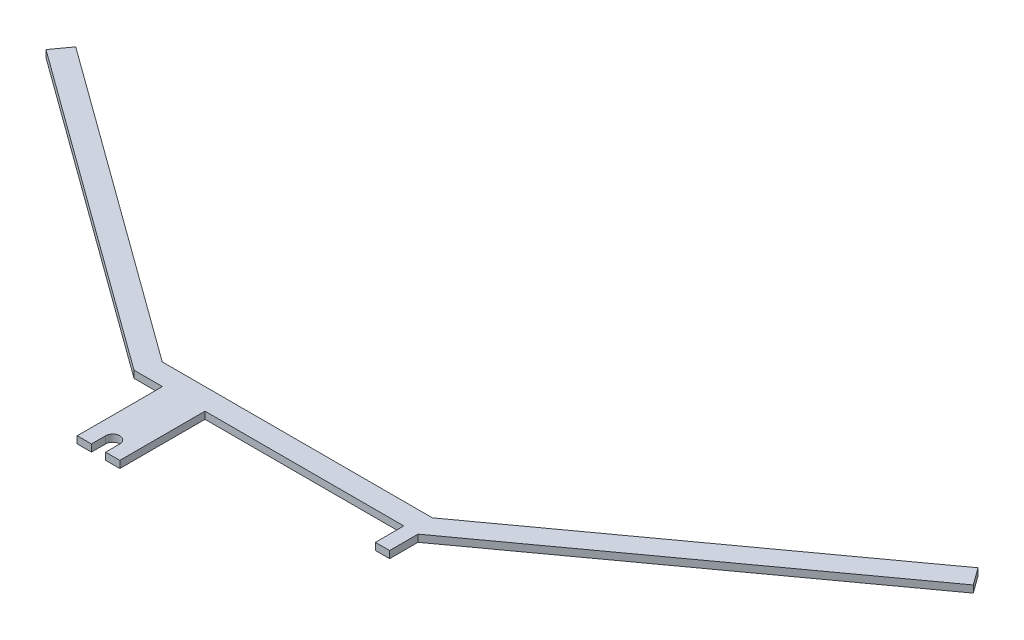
from build123d import *

# Parameters (mm, degrees)
EXTRUDE_1_DEPTH     = 0.25
SKETCH_2_W          = 1
SKETCH_2_H          = 2
EXTRUDE_2_DEPTH     = 0.5
SKETCH_5_W          = 4.537094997
SKETCH_5_H          = 4.32216947
CUT_EXTRUDE_1_DEPTH = 59.470879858
SKETCH_6_W          = 3
SKETCH_6_H          = 6
EXTRUDE_3_DEPTH     = 0.5
CUT_EXTRUDE_2_DEPTH = 62.829150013
SKETCH_8_W          = 1
SKETCH_8_H          = 2
EXTRUDE_4_DEPTH     = 0.5
SKETCH_9_W          = 3.605018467
SKETCH_9_H          = 3.214260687
CUT_EXTRUDE_3_DEPTH = 62.829150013


with BuildPart() as part:
    # Sketch 1 → Extrude 1 (new, symmetric)
    with BuildSketch(Plane(origin=(0, 0, 0), x_dir=(1, 0, 0), z_dir=(0, 1, 0))):
        Polygon((-31.773422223, -28.831720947), (-9.512743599, -45), (9.512743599, -45), (31.773422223, -28.831720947), (32.654919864, -30.045377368), (10, -46.5), (-10, -46.5), (-32.654919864, -30.045377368), align=None)
    extrude(amount=EXTRUDE_1_DEPTH, both=True)

    # Sketch 2 → Extrude 2 (add)
    with BuildSketch(Plane(origin=(0, 0.25, 0), x_dir=(1, 0, 0), z_dir=(0, 1, 0))):
        with Locations((-9.5, -47.5)):
            Rectangle(SKETCH_2_W, SKETCH_2_H)
        with Locations((9.5, -47.5)):
            Rectangle(SKETCH_2_W, SKETCH_2_H)
    extrude(amount=-EXTRUDE_2_DEPTH)

    # Sketch 5 → Cut-Extrude 1 (cut, through all)
    with BuildSketch(Plane.XZ.offset(0.25)):
        with Locations((11.268547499, 48.661084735)):
            Rectangle(SKETCH_5_W, SKETCH_5_H)
    extrude(amount=-CUT_EXTRUDE_1_DEPTH, mode=Mode.SUBTRACT)

    # Sketch 6 → Extrude 3 (add)
    with BuildSketch(Plane.XZ.offset(0.25)):
        with Locations((-6.5, 49.5)):
            Rectangle(SKETCH_6_W, SKETCH_6_H)
    extrude(amount=-EXTRUDE_3_DEPTH)

    # Sketch 7 → Cut-Extrude 2 (cut, through all)
    with BuildSketch(Plane.XZ.offset(0.25)):
        with BuildLine():
            Line((-7, 51.5), (-7, 55.278413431))
            Line((-7, 55.278413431), (-6, 55.278413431))
            Line((-6, 55.278413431), (-6, 51.5))
            ThreePointArc((-6, 51.5), (-6.5, 51), (-7, 51.5))
        make_face()
    extrude(amount=-CUT_EXTRUDE_2_DEPTH, mode=Mode.SUBTRACT)

    # Sketch 8 → Extrude 4 (add)
    with BuildSketch(Plane.XZ.offset(0.25)):
        with Locations((9.5, 47.5)):
            Rectangle(SKETCH_8_W, SKETCH_8_H)
    extrude(amount=-EXTRUDE_4_DEPTH)

    # Sketch 9 → Cut-Extrude 3 (cut, through all)
    with BuildSketch(Plane.XZ.offset(0.25)):
        with Locations((-10.802509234, 48.107130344)):
            Rectangle(SKETCH_9_W, SKETCH_9_H)
    extrude(amount=-CUT_EXTRUDE_3_DEPTH, mode=Mode.SUBTRACT)


solid = part.part
